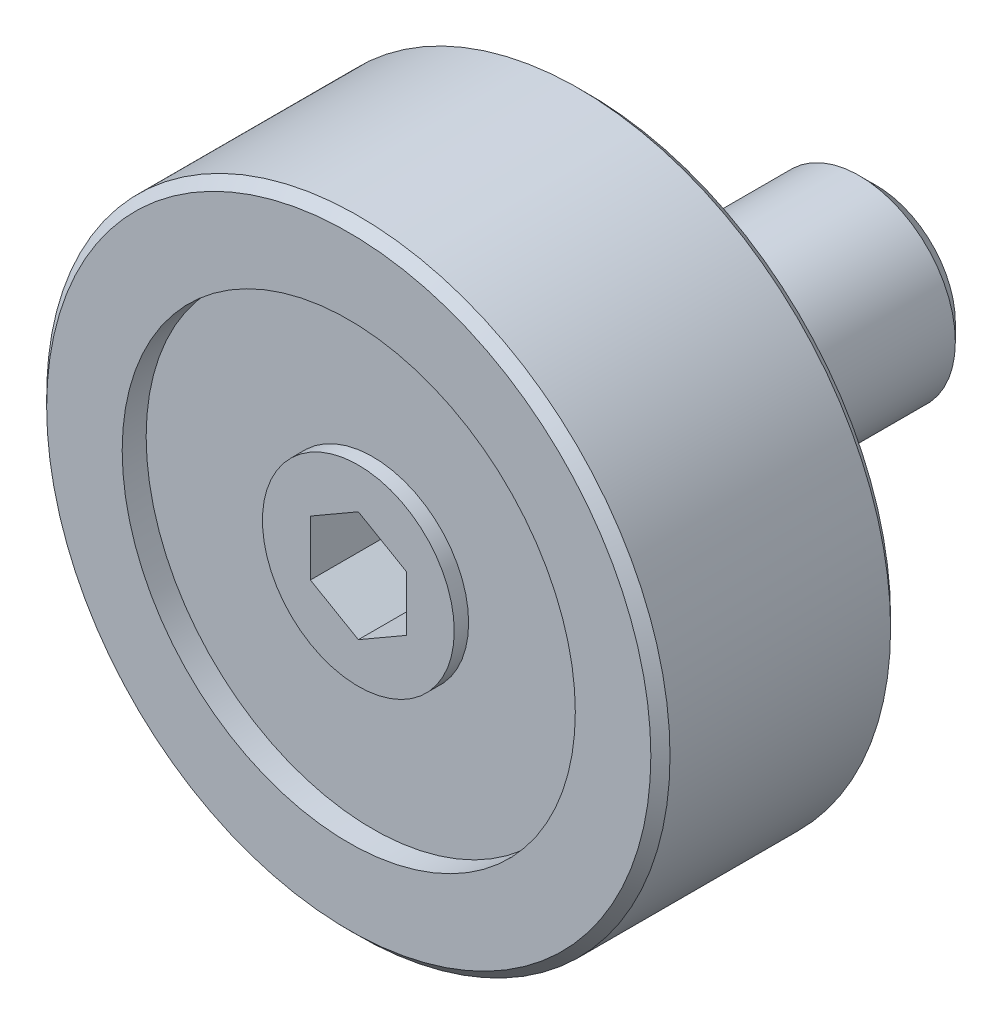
ISO-10303-21;
HEADER;
FILE_DESCRIPTION(('STEP AP214'),'2;1');
FILE_NAME('part.step','',(''),(''),'','','');
FILE_SCHEMA(('AUTOMOTIVE_DESIGN { 1 0 10303 214 1 1 1 1 }'));
ENDSEC;
DATA;
#1=APPLICATION_CONTEXT('core data for automotive mechanical design processes');
#2=APPLICATION_PROTOCOL_DEFINITION('international standard','automotive_design',2000,#1);
#3=PRODUCT_CONTEXT('',#1,'mechanical');
#4=PRODUCT('Part','Part','',(#3));
#5=PRODUCT_RELATED_PRODUCT_CATEGORY('part','',(#4));
#6=PRODUCT_DEFINITION_FORMATION('','',#4);
#7=PRODUCT_DEFINITION_CONTEXT('part definition',#1,'design');
#8=PRODUCT_DEFINITION('design','',#6,#7);
#9=PRODUCT_DEFINITION_SHAPE('','',#8);
#10=(LENGTH_UNIT() NAMED_UNIT(*) SI_UNIT(.MILLI.,.METRE.));
#11=(NAMED_UNIT(*) PLANE_ANGLE_UNIT() SI_UNIT($,.RADIAN.));
#12=(NAMED_UNIT(*) SI_UNIT($,.STERADIAN.) SOLID_ANGLE_UNIT());
#13=UNCERTAINTY_MEASURE_WITH_UNIT(LENGTH_MEASURE(1.E-05),#10,'distance_accuracy_value','');
#14=(GEOMETRIC_REPRESENTATION_CONTEXT(3) GLOBAL_UNCERTAINTY_ASSIGNED_CONTEXT((#13)) GLOBAL_UNIT_ASSIGNED_CONTEXT((#10,
#11,#12)) REPRESENTATION_CONTEXT('',''));
#15=CARTESIAN_POINT('',(0.,0.,0.));
#16=DIRECTION('',(0.,0.,1.));
#17=DIRECTION('',(1.,0.,0.));
#18=AXIS2_PLACEMENT_3D('',#15,#16,#17);
#19=CARTESIAN_POINT('',(0.,0.,1.19999999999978));
#20=DIRECTION('',(0.,0.,1.));
#21=DIRECTION('',(1.,0.,0.));
#22=AXIS2_PLACEMENT_3D('',#19,#20,#21);
#23=CONICAL_SURFACE('',#22,6.5,0.785398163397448);
#24=CARTESIAN_POINT('',(0.,0.,1.00000000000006));
#25=DIRECTION('',(0.,0.,1.));
#26=DIRECTION('',(1.,0.,0.));
#27=AXIS2_PLACEMENT_3D('',#24,#25,#26);
#28=CIRCLE('',#27,6.30000000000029);
#29=CARTESIAN_POINT('',(6.30000000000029,0.,1.00000000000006));
#30=VERTEX_POINT('',#29);
#31=EDGE_CURVE('E115',#30,#30,#28,.T.);
#32=ORIENTED_EDGE('',*,*,#31,.T.);
#33=EDGE_LOOP('',(#32));
#34=FACE_BOUND('',#33,.T.);
#35=CARTESIAN_POINT('',(0.,0.,1.19999999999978));
#36=DIRECTION('',(0.,0.,1.));
#37=DIRECTION('',(1.,0.,0.));
#38=AXIS2_PLACEMENT_3D('',#35,#36,#37);
#39=CIRCLE('',#38,6.5);
#40=CARTESIAN_POINT('',(6.5,0.,1.19999999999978));
#41=VERTEX_POINT('',#40);
#42=EDGE_CURVE('E9',#41,#41,#39,.T.);
#43=ORIENTED_EDGE('',*,*,#42,.F.);
#44=EDGE_LOOP('',(#43));
#45=FACE_BOUND('',#44,.T.);
#46=ADVANCED_FACE('F14',(#34,#45),#23,.T.);
#47=CARTESIAN_POINT('',(0.,0.,9.));
#48=DIRECTION('',(0.,0.,1.));
#49=DIRECTION('',(1.,0.,0.));
#50=AXIS2_PLACEMENT_3D('',#47,#48,#49);
#51=CYLINDRICAL_SURFACE('',#50,6.5);
#52=ORIENTED_EDGE('',*,*,#42,.T.);
#53=EDGE_LOOP('',(#52));
#54=FACE_BOUND('',#53,.T.);
#55=CARTESIAN_POINT('',(0.,0.,5.79999999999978));
#56=DIRECTION('',(0.,0.,1.));
#57=DIRECTION('',(1.,0.,0.));
#58=AXIS2_PLACEMENT_3D('',#55,#56,#57);
#59=CIRCLE('',#58,6.5);
#60=CARTESIAN_POINT('',(6.5,0.,5.79999999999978));
#61=VERTEX_POINT('',#60);
#62=EDGE_CURVE('E21',#61,#61,#59,.T.);
#63=ORIENTED_EDGE('',*,*,#62,.F.);
#64=EDGE_LOOP('',(#63));
#65=FACE_BOUND('',#64,.T.);
#66=ADVANCED_FACE('F170',(#54,#65),#51,.T.);
#67=CARTESIAN_POINT('',(0.,0.,5.99999999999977));
#68=DIRECTION('',(0.,0.,-1.));
#69=DIRECTION('',(-1.,0.,0.));
#70=AXIS2_PLACEMENT_3D('',#67,#68,#69);
#71=CONICAL_SURFACE('',#70,6.3,0.785398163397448);
#72=ORIENTED_EDGE('',*,*,#62,.T.);
#73=EDGE_LOOP('',(#72));
#74=FACE_BOUND('',#73,.T.);
#75=CARTESIAN_POINT('',(0.,0.,5.99999999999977));
#76=DIRECTION('',(0.,0.,1.));
#77=DIRECTION('',(1.,0.,0.));
#78=AXIS2_PLACEMENT_3D('',#75,#76,#77);
#79=CIRCLE('',#78,6.3);
#80=CARTESIAN_POINT('',(6.3,0.,5.99999999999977));
#81=VERTEX_POINT('',#80);
#82=EDGE_CURVE('E162',#81,#81,#79,.T.);
#83=ORIENTED_EDGE('',*,*,#82,.F.);
#84=EDGE_LOOP('',(#83));
#85=FACE_BOUND('',#84,.T.);
#86=ADVANCED_FACE('F167',(#74,#85),#71,.T.);
#87=CARTESIAN_POINT('',(0.,6.3,5.99999999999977));
#88=DIRECTION('',(0.,0.,1.));
#89=DIRECTION('',(1.,0.,0.));
#90=AXIS2_PLACEMENT_3D('',#87,#88,#89);
#91=PLANE('',#90);
#92=ORIENTED_EDGE('',*,*,#82,.T.);
#93=EDGE_LOOP('',(#92));
#94=FACE_BOUND('',#93,.T.);
#95=CARTESIAN_POINT('',(0.,0.,5.99999999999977));
#96=DIRECTION('',(0.,0.,1.));
#97=DIRECTION('',(1.,0.,0.));
#98=AXIS2_PLACEMENT_3D('',#95,#96,#97);
#99=CIRCLE('',#98,4.725);
#100=CARTESIAN_POINT('',(4.725,0.,5.99999999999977));
#101=VERTEX_POINT('',#100);
#102=EDGE_CURVE('E159',#101,#101,#99,.T.);
#103=ORIENTED_EDGE('',*,*,#102,.F.);
#104=EDGE_LOOP('',(#103));
#105=FACE_BOUND('',#104,.T.);
#106=ADVANCED_FACE('F179',(#94,#105),#91,.T.);
#107=CARTESIAN_POINT('',(0.,0.,9.));
#108=DIRECTION('',(0.,0.,1.));
#109=DIRECTION('',(1.,0.,0.));
#110=AXIS2_PLACEMENT_3D('',#107,#108,#109);
#111=CYLINDRICAL_SURFACE('',#110,4.725);
#112=ORIENTED_EDGE('',*,*,#102,.T.);
#113=EDGE_LOOP('',(#112));
#114=FACE_BOUND('',#113,.T.);
#115=CARTESIAN_POINT('',(0.,0.,5.49999999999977));
#116=DIRECTION('',(0.,0.,1.));
#117=DIRECTION('',(1.,0.,0.));
#118=AXIS2_PLACEMENT_3D('',#115,#116,#117);
#119=CIRCLE('',#118,4.725);
#120=CARTESIAN_POINT('',(4.725,0.,5.49999999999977));
#121=VERTEX_POINT('',#120);
#122=EDGE_CURVE('E156',#121,#121,#119,.T.);
#123=ORIENTED_EDGE('',*,*,#122,.F.);
#124=EDGE_LOOP('',(#123));
#125=FACE_BOUND('',#124,.T.);
#126=ADVANCED_FACE('F185',(#114,#125),#111,.F.);
#127=CARTESIAN_POINT('',(0.,4.725,5.49999999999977));
#128=DIRECTION('',(0.,0.,1.));
#129=DIRECTION('',(1.,0.,0.));
#130=AXIS2_PLACEMENT_3D('',#127,#128,#129);
#131=PLANE('',#130);
#132=ORIENTED_EDGE('',*,*,#122,.T.);
#133=EDGE_LOOP('',(#132));
#134=FACE_BOUND('',#133,.T.);
#135=CARTESIAN_POINT('',(0.,0.,5.49999999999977));
#136=DIRECTION('',(0.,0.,1.));
#137=DIRECTION('',(1.,0.,0.));
#138=AXIS2_PLACEMENT_3D('',#135,#136,#137);
#139=CIRCLE('',#138,2.);
#140=CARTESIAN_POINT('',(2.,0.,5.49999999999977));
#141=VERTEX_POINT('',#140);
#142=EDGE_CURVE('E153',#141,#141,#139,.T.);
#143=ORIENTED_EDGE('',*,*,#142,.F.);
#144=EDGE_LOOP('',(#143));
#145=FACE_BOUND('',#144,.T.);
#146=ADVANCED_FACE('F189',(#134,#145),#131,.T.);
#147=CARTESIAN_POINT('',(0.,0.,9.));
#148=DIRECTION('',(0.,0.,1.));
#149=DIRECTION('',(1.,0.,0.));
#150=AXIS2_PLACEMENT_3D('',#147,#148,#149);
#151=CYLINDRICAL_SURFACE('',#150,2.);
#152=ORIENTED_EDGE('',*,*,#142,.T.);
#153=EDGE_LOOP('',(#152));
#154=FACE_BOUND('',#153,.T.);
#155=CARTESIAN_POINT('',(0.,0.,5.79999999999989));
#156=DIRECTION('',(0.,0.,1.));
#157=DIRECTION('',(1.,0.,0.));
#158=AXIS2_PLACEMENT_3D('',#155,#156,#157);
#159=CIRCLE('',#158,2.);
#160=CARTESIAN_POINT('',(2.,0.,5.79999999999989));
#161=VERTEX_POINT('',#160);
#162=EDGE_CURVE('E150',#161,#161,#159,.T.);
#163=ORIENTED_EDGE('',*,*,#162,.F.);
#164=EDGE_LOOP('',(#163));
#165=FACE_BOUND('',#164,.T.);
#166=ADVANCED_FACE('F193',(#154,#165),#151,.T.);
#167=CARTESIAN_POINT('',(0.,2.,5.79999999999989));
#168=DIRECTION('',(0.,0.,1.));
#169=DIRECTION('',(1.,0.,0.));
#170=AXIS2_PLACEMENT_3D('',#167,#168,#169);
#171=PLANE('',#170);
#172=DIRECTION('',(-0.866025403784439,0.5,0.));
#173=VECTOR('',#172,1.);
#174=CARTESIAN_POINT('',(1.,0.577350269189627,5.79999999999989));
#175=LINE('',#174,#173);
#176=CARTESIAN_POINT('',(1.,0.577350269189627,5.79999999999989));
#177=VERTEX_POINT('',#176);
#178=CARTESIAN_POINT('',(0.,1.15470053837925,5.79999999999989));
#179=VERTEX_POINT('',#178);
#180=EDGE_CURVE('E28',#177,#179,#175,.T.);
#181=ORIENTED_EDGE('',*,*,#180,.F.);
#182=DIRECTION('',(0.,1.,0.));
#183=VECTOR('',#182,1.);
#184=CARTESIAN_POINT('',(1.,-0.577350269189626,5.79999999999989));
#185=LINE('',#184,#183);
#186=CARTESIAN_POINT('',(1.,-0.577350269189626,5.79999999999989));
#187=VERTEX_POINT('',#186);
#188=EDGE_CURVE('E111',#187,#177,#185,.T.);
#189=ORIENTED_EDGE('',*,*,#188,.F.);
#190=DIRECTION('',(0.866025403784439,0.5,0.));
#191=VECTOR('',#190,1.);
#192=CARTESIAN_POINT('',(0.,-1.15470053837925,5.79999999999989));
#193=LINE('',#192,#191);
#194=CARTESIAN_POINT('',(0.,-1.15470053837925,5.79999999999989));
#195=VERTEX_POINT('',#194);
#196=EDGE_CURVE('E109',#195,#187,#193,.T.);
#197=ORIENTED_EDGE('',*,*,#196,.F.);
#198=DIRECTION('',(0.866025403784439,-0.5,0.));
#199=VECTOR('',#198,1.);
#200=CARTESIAN_POINT('',(-1.,-0.577350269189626,5.79999999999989));
#201=LINE('',#200,#199);
#202=CARTESIAN_POINT('',(-1.,-0.577350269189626,5.79999999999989));
#203=VERTEX_POINT('',#202);
#204=EDGE_CURVE('E76',#203,#195,#201,.T.);
#205=ORIENTED_EDGE('',*,*,#204,.F.);
#206=DIRECTION('',(0.,-1.,0.));
#207=VECTOR('',#206,1.);
#208=CARTESIAN_POINT('',(-1.,0.577350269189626,5.79999999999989));
#209=LINE('',#208,#207);
#210=CARTESIAN_POINT('',(-1.,0.577350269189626,5.79999999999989));
#211=VERTEX_POINT('',#210);
#212=EDGE_CURVE('E105',#211,#203,#209,.T.);
#213=ORIENTED_EDGE('',*,*,#212,.F.);
#214=DIRECTION('',(-0.866025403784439,-0.5,0.));
#215=VECTOR('',#214,1.);
#216=CARTESIAN_POINT('',(0.,1.15470053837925,5.79999999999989));
#217=LINE('',#216,#215);
#218=EDGE_CURVE('E102',#179,#211,#217,.T.);
#219=ORIENTED_EDGE('',*,*,#218,.F.);
#220=EDGE_LOOP('',(#181,#189,#197,#205,#213,#219));
#221=FACE_BOUND('',#220,.T.);
#222=ORIENTED_EDGE('',*,*,#162,.T.);
#223=EDGE_LOOP('',(#222));
#224=FACE_BOUND('',#223,.T.);
#225=ADVANCED_FACE('F197',(#221,#224),#171,.T.);
#226=CARTESIAN_POINT('',(0.,-1.32413961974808E-13,-5.));
#227=DIRECTION('',(0.,0.,-1.));
#228=DIRECTION('',(-1.,0.,0.));
#229=AXIS2_PLACEMENT_3D('',#226,#227,#228);
#230=PLANE('',#229);
#231=CARTESIAN_POINT('',(0.,0.,-5.));
#232=DIRECTION('',(0.,0.,1.));
#233=DIRECTION('',(1.,0.,0.));
#234=AXIS2_PLACEMENT_3D('',#231,#232,#233);
#235=CIRCLE('',#234,1.64999999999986);
#236=CARTESIAN_POINT('',(1.64999999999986,0.,-5.));
#237=VERTEX_POINT('',#236);
#238=EDGE_CURVE('E147',#237,#237,#235,.T.);
#239=ORIENTED_EDGE('',*,*,#238,.F.);
#240=EDGE_LOOP('',(#239));
#241=FACE_BOUND('',#240,.T.);
#242=ADVANCED_FACE('F201',(#241),#230,.T.);
#243=CARTESIAN_POINT('',(0.,0.,-4.65));
#244=DIRECTION('',(0.,0.,1.));
#245=DIRECTION('',(1.,0.,0.));
#246=AXIS2_PLACEMENT_3D('',#243,#244,#245);
#247=CONICAL_SURFACE('',#246,1.99999999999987,0.785398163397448);
#248=ORIENTED_EDGE('',*,*,#238,.T.);
#249=EDGE_LOOP('',(#248));
#250=FACE_BOUND('',#249,.T.);
#251=CARTESIAN_POINT('',(0.,0.,-4.65));
#252=DIRECTION('',(0.,0.,1.));
#253=DIRECTION('',(1.,0.,0.));
#254=AXIS2_PLACEMENT_3D('',#251,#252,#253);
#255=CIRCLE('',#254,1.99999999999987);
#256=CARTESIAN_POINT('',(1.99999999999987,0.,-4.65));
#257=VERTEX_POINT('',#256);
#258=EDGE_CURVE('E144',#257,#257,#255,.T.);
#259=ORIENTED_EDGE('',*,*,#258,.F.);
#260=EDGE_LOOP('',(#259));
#261=FACE_BOUND('',#260,.T.);
#262=ADVANCED_FACE('F205',(#250,#261),#247,.T.);
#263=CARTESIAN_POINT('',(0.,0.,9.));
#264=DIRECTION('',(0.,0.,1.));
#265=DIRECTION('',(1.,0.,0.));
#266=AXIS2_PLACEMENT_3D('',#263,#264,#265);
#267=CYLINDRICAL_SURFACE('',#266,1.99999999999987);
#268=ORIENTED_EDGE('',*,*,#258,.T.);
#269=EDGE_LOOP('',(#268));
#270=FACE_BOUND('',#269,.T.);
#271=CARTESIAN_POINT('',(0.,0.,-1.));
#272=DIRECTION('',(0.,0.,1.));
#273=DIRECTION('',(1.,0.,0.));
#274=AXIS2_PLACEMENT_3D('',#271,#272,#273);
#275=CIRCLE('',#274,1.99999999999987);
#276=CARTESIAN_POINT('',(1.99999999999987,0.,-1.));
#277=VERTEX_POINT('',#276);
#278=EDGE_CURVE('E141',#277,#277,#275,.T.);
#279=ORIENTED_EDGE('',*,*,#278,.F.);
#280=EDGE_LOOP('',(#279));
#281=FACE_BOUND('',#280,.T.);
#282=ADVANCED_FACE('F209',(#270,#281),#267,.T.);
#283=CARTESIAN_POINT('',(0.,1.44999999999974,-1.));
#284=DIRECTION('',(0.,0.,1.));
#285=DIRECTION('',(1.,0.,0.));
#286=AXIS2_PLACEMENT_3D('',#283,#284,#285);
#287=PLANE('',#286);
#288=ORIENTED_EDGE('',*,*,#278,.T.);
#289=EDGE_LOOP('',(#288));
#290=FACE_BOUND('',#289,.T.);
#291=CARTESIAN_POINT('',(0.,0.,-1.));
#292=DIRECTION('',(0.,0.,1.));
#293=DIRECTION('',(1.,0.,0.));
#294=AXIS2_PLACEMENT_3D('',#291,#292,#293);
#295=CIRCLE('',#294,1.44999999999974);
#296=CARTESIAN_POINT('',(1.44999999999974,0.,-1.));
#297=VERTEX_POINT('',#296);
#298=EDGE_CURVE('E138',#297,#297,#295,.T.);
#299=ORIENTED_EDGE('',*,*,#298,.F.);
#300=EDGE_LOOP('',(#299));
#301=FACE_BOUND('',#300,.T.);
#302=ADVANCED_FACE('F213',(#290,#301),#287,.T.);
#303=CARTESIAN_POINT('',(0.,0.,9.));
#304=DIRECTION('',(0.,0.,1.));
#305=DIRECTION('',(1.,0.,0.));
#306=AXIS2_PLACEMENT_3D('',#303,#304,#305);
#307=CYLINDRICAL_SURFACE('',#306,1.44999999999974);
#308=ORIENTED_EDGE('',*,*,#298,.T.);
#309=EDGE_LOOP('',(#308));
#310=FACE_BOUND('',#309,.T.);
#311=CARTESIAN_POINT('',(0.,0.,0.));
#312=DIRECTION('',(0.,0.,1.));
#313=DIRECTION('',(1.,0.,0.));
#314=AXIS2_PLACEMENT_3D('',#311,#312,#313);
#315=CIRCLE('',#314,1.44999999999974);
#316=CARTESIAN_POINT('',(1.44999999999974,0.,0.));
#317=VERTEX_POINT('',#316);
#318=EDGE_CURVE('E135',#317,#317,#315,.T.);
#319=ORIENTED_EDGE('',*,*,#318,.F.);
#320=EDGE_LOOP('',(#319));
#321=FACE_BOUND('',#320,.T.);
#322=ADVANCED_FACE('F217',(#310,#321),#307,.T.);
#323=CARTESIAN_POINT('',(0.,2.99999999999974,0.));
#324=DIRECTION('',(0.,0.,-1.));
#325=DIRECTION('',(-1.,0.,0.));
#326=AXIS2_PLACEMENT_3D('',#323,#324,#325);
#327=PLANE('',#326);
#328=ORIENTED_EDGE('',*,*,#318,.T.);
#329=EDGE_LOOP('',(#328));
#330=FACE_BOUND('',#329,.T.);
#331=CARTESIAN_POINT('',(0.,0.,0.));
#332=DIRECTION('',(0.,0.,1.));
#333=DIRECTION('',(1.,0.,0.));
#334=AXIS2_PLACEMENT_3D('',#331,#332,#333);
#335=CIRCLE('',#334,2.99999999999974);
#336=CARTESIAN_POINT('',(2.99999999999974,0.,0.));
#337=VERTEX_POINT('',#336);
#338=EDGE_CURVE('E132',#337,#337,#335,.T.);
#339=ORIENTED_EDGE('',*,*,#338,.F.);
#340=EDGE_LOOP('',(#339));
#341=FACE_BOUND('',#340,.T.);
#342=ADVANCED_FACE('F221',(#330,#341),#327,.T.);
#343=CARTESIAN_POINT('',(0.,0.,9.));
#344=DIRECTION('',(0.,0.,1.));
#345=DIRECTION('',(1.,0.,0.));
#346=AXIS2_PLACEMENT_3D('',#343,#344,#345);
#347=CYLINDRICAL_SURFACE('',#346,2.99999999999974);
#348=ORIENTED_EDGE('',*,*,#338,.T.);
#349=EDGE_LOOP('',(#348));
#350=FACE_BOUND('',#349,.T.);
#351=CARTESIAN_POINT('',(0.,0.,1.5));
#352=DIRECTION('',(0.,0.,1.));
#353=DIRECTION('',(1.,0.,0.));
#354=AXIS2_PLACEMENT_3D('',#351,#352,#353);
#355=CIRCLE('',#354,2.99999999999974);
#356=CARTESIAN_POINT('',(2.99999999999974,0.,1.5));
#357=VERTEX_POINT('',#356);
#358=EDGE_CURVE('E129',#357,#357,#355,.T.);
#359=ORIENTED_EDGE('',*,*,#358,.F.);
#360=EDGE_LOOP('',(#359));
#361=FACE_BOUND('',#360,.T.);
#362=ADVANCED_FACE('F225',(#350,#361),#347,.T.);
#363=CARTESIAN_POINT('',(0.,2.99999999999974,1.5));
#364=DIRECTION('',(0.,0.,-1.));
#365=DIRECTION('',(-1.,0.,0.));
#366=AXIS2_PLACEMENT_3D('',#363,#364,#365);
#367=PLANE('',#366);
#368=ORIENTED_EDGE('',*,*,#358,.T.);
#369=EDGE_LOOP('',(#368));
#370=FACE_BOUND('',#369,.T.);
#371=CARTESIAN_POINT('',(0.,0.,1.5));
#372=DIRECTION('',(0.,0.,1.));
#373=DIRECTION('',(1.,0.,0.));
#374=AXIS2_PLACEMENT_3D('',#371,#372,#373);
#375=CIRCLE('',#374,4.72500000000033);
#376=CARTESIAN_POINT('',(4.72500000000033,0.,1.5));
#377=VERTEX_POINT('',#376);
#378=EDGE_CURVE('E126',#377,#377,#375,.T.);
#379=ORIENTED_EDGE('',*,*,#378,.F.);
#380=EDGE_LOOP('',(#379));
#381=FACE_BOUND('',#380,.T.);
#382=ADVANCED_FACE('F229',(#370,#381),#367,.T.);
#383=CARTESIAN_POINT('',(0.,0.,9.));
#384=DIRECTION('',(0.,0.,1.));
#385=DIRECTION('',(1.,0.,0.));
#386=AXIS2_PLACEMENT_3D('',#383,#384,#385);
#387=CYLINDRICAL_SURFACE('',#386,4.72500000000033);
#388=ORIENTED_EDGE('',*,*,#378,.T.);
#389=EDGE_LOOP('',(#388));
#390=FACE_BOUND('',#389,.T.);
#391=CARTESIAN_POINT('',(0.,0.,1.00000000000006));
#392=DIRECTION('',(0.,0.,1.));
#393=DIRECTION('',(1.,0.,0.));
#394=AXIS2_PLACEMENT_3D('',#391,#392,#393);
#395=CIRCLE('',#394,4.72500000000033);
#396=CARTESIAN_POINT('',(4.72500000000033,0.,1.00000000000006));
#397=VERTEX_POINT('',#396);
#398=EDGE_CURVE('E123',#397,#397,#395,.T.);
#399=ORIENTED_EDGE('',*,*,#398,.F.);
#400=EDGE_LOOP('',(#399));
#401=FACE_BOUND('',#400,.T.);
#402=ADVANCED_FACE('F233',(#390,#401),#387,.F.);
#403=CARTESIAN_POINT('',(0.,6.30000000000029,1.00000000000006));
#404=DIRECTION('',(0.,0.,-1.));
#405=DIRECTION('',(-1.,0.,0.));
#406=AXIS2_PLACEMENT_3D('',#403,#404,#405);
#407=PLANE('',#406);
#408=ORIENTED_EDGE('',*,*,#398,.T.);
#409=EDGE_LOOP('',(#408));
#410=FACE_BOUND('',#409,.T.);
#411=ORIENTED_EDGE('',*,*,#31,.F.);
#412=EDGE_LOOP('',(#411));
#413=FACE_BOUND('',#412,.T.);
#414=ADVANCED_FACE('F237',(#410,#413),#407,.T.);
#415=CARTESIAN_POINT('',(1.,0.577350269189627,4.19999999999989));
#416=DIRECTION('',(0.5,0.866025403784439,0.));
#417=DIRECTION('',(-0.866025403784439,0.5,0.));
#418=AXIS2_PLACEMENT_3D('',#415,#416,#417);
#419=PLANE('',#418);
#420=ORIENTED_EDGE('',*,*,#180,.T.);
#421=DIRECTION('',(0.,0.,1.));
#422=VECTOR('',#421,1.);
#423=CARTESIAN_POINT('',(0.,1.15470053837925,4.19999999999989));
#424=LINE('',#423,#422);
#425=CARTESIAN_POINT('',(0.,1.15470053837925,4.19999999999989));
#426=VERTEX_POINT('',#425);
#427=EDGE_CURVE('E58',#426,#179,#424,.T.);
#428=ORIENTED_EDGE('',*,*,#427,.F.);
#429=DIRECTION('',(-0.866025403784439,0.5,0.));
#430=VECTOR('',#429,1.);
#431=CARTESIAN_POINT('',(1.,0.577350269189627,4.19999999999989));
#432=LINE('',#431,#430);
#433=CARTESIAN_POINT('',(1.,0.577350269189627,4.19999999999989));
#434=VERTEX_POINT('',#433);
#435=EDGE_CURVE('E113',#434,#426,#432,.T.);
#436=ORIENTED_EDGE('',*,*,#435,.F.);
#437=DIRECTION('',(0.,0.,1.));
#438=VECTOR('',#437,1.);
#439=CARTESIAN_POINT('',(1.,0.577350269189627,4.19999999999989));
#440=LINE('',#439,#438);
#441=EDGE_CURVE('E36',#434,#177,#440,.T.);
#442=ORIENTED_EDGE('',*,*,#441,.T.);
#443=EDGE_LOOP('',(#420,#428,#436,#442));
#444=FACE_BOUND('',#443,.T.);
#445=ADVANCED_FACE('F241',(#444),#419,.F.);
#446=CARTESIAN_POINT('',(1.,-0.577350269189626,4.19999999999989));
#447=DIRECTION('',(1.,0.,0.));
#448=DIRECTION('',(0.,0.,-1.));
#449=AXIS2_PLACEMENT_3D('',#446,#447,#448);
#450=PLANE('',#449);
#451=ORIENTED_EDGE('',*,*,#188,.T.);
#452=ORIENTED_EDGE('',*,*,#441,.F.);
#453=DIRECTION('',(0.,1.,0.));
#454=VECTOR('',#453,1.);
#455=CARTESIAN_POINT('',(1.,-0.577350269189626,4.19999999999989));
#456=LINE('',#455,#454);
#457=CARTESIAN_POINT('',(1.,-0.577350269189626,4.19999999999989));
#458=VERTEX_POINT('',#457);
#459=EDGE_CURVE('E88',#458,#434,#456,.T.);
#460=ORIENTED_EDGE('',*,*,#459,.F.);
#461=DIRECTION('',(0.,0.,1.));
#462=VECTOR('',#461,1.);
#463=CARTESIAN_POINT('',(1.,-0.577350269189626,4.19999999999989));
#464=LINE('',#463,#462);
#465=EDGE_CURVE('E80',#458,#187,#464,.T.);
#466=ORIENTED_EDGE('',*,*,#465,.T.);
#467=EDGE_LOOP('',(#451,#452,#460,#466));
#468=FACE_BOUND('',#467,.T.);
#469=ADVANCED_FACE('F245',(#468),#450,.F.);
#470=CARTESIAN_POINT('',(0.,-1.15470053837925,4.19999999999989));
#471=DIRECTION('',(0.5,-0.866025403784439,0.));
#472=DIRECTION('',(0.866025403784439,0.5,0.));
#473=AXIS2_PLACEMENT_3D('',#470,#471,#472);
#474=PLANE('',#473);
#475=ORIENTED_EDGE('',*,*,#196,.T.);
#476=ORIENTED_EDGE('',*,*,#465,.F.);
#477=DIRECTION('',(0.866025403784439,0.5,0.));
#478=VECTOR('',#477,1.);
#479=CARTESIAN_POINT('',(0.,-1.15470053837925,4.19999999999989));
#480=LINE('',#479,#478);
#481=CARTESIAN_POINT('',(0.,-1.15470053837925,4.19999999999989));
#482=VERTEX_POINT('',#481);
#483=EDGE_CURVE('E84',#482,#458,#480,.T.);
#484=ORIENTED_EDGE('',*,*,#483,.F.);
#485=DIRECTION('',(0.,0.,1.));
#486=VECTOR('',#485,1.);
#487=CARTESIAN_POINT('',(0.,-1.15470053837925,4.19999999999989));
#488=LINE('',#487,#486);
#489=EDGE_CURVE('E69',#482,#195,#488,.T.);
#490=ORIENTED_EDGE('',*,*,#489,.T.);
#491=EDGE_LOOP('',(#475,#476,#484,#490));
#492=FACE_BOUND('',#491,.T.);
#493=ADVANCED_FACE('F85',(#492),#474,.F.);
#494=CARTESIAN_POINT('',(-1.,-0.577350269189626,4.19999999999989));
#495=DIRECTION('',(-0.5,-0.866025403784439,0.));
#496=DIRECTION('',(0.866025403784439,-0.5,0.));
#497=AXIS2_PLACEMENT_3D('',#494,#495,#496);
#498=PLANE('',#497);
#499=ORIENTED_EDGE('',*,*,#204,.T.);
#500=ORIENTED_EDGE('',*,*,#489,.F.);
#501=DIRECTION('',(0.866025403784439,-0.5,0.));
#502=VECTOR('',#501,1.);
#503=CARTESIAN_POINT('',(-1.,-0.577350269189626,4.19999999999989));
#504=LINE('',#503,#502);
#505=CARTESIAN_POINT('',(-1.,-0.577350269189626,4.19999999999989));
#506=VERTEX_POINT('',#505);
#507=EDGE_CURVE('E73',#506,#482,#504,.T.);
#508=ORIENTED_EDGE('',*,*,#507,.F.);
#509=DIRECTION('',(0.,0.,1.));
#510=VECTOR('',#509,1.);
#511=CARTESIAN_POINT('',(-1.,-0.577350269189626,4.19999999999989));
#512=LINE('',#511,#510);
#513=EDGE_CURVE('E81',#506,#203,#512,.T.);
#514=ORIENTED_EDGE('',*,*,#513,.T.);
#515=EDGE_LOOP('',(#499,#500,#508,#514));
#516=FACE_BOUND('',#515,.T.);
#517=ADVANCED_FACE('F71',(#516),#498,.F.);
#518=CARTESIAN_POINT('',(-1.,0.577350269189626,4.19999999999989));
#519=DIRECTION('',(-1.,0.,0.));
#520=DIRECTION('',(0.,-1.,0.));
#521=AXIS2_PLACEMENT_3D('',#518,#519,#520);
#522=PLANE('',#521);
#523=ORIENTED_EDGE('',*,*,#212,.T.);
#524=ORIENTED_EDGE('',*,*,#513,.F.);
#525=DIRECTION('',(0.,-1.,0.));
#526=VECTOR('',#525,1.);
#527=CARTESIAN_POINT('',(-1.,0.577350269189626,4.19999999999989));
#528=LINE('',#527,#526);
#529=CARTESIAN_POINT('',(-1.,0.577350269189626,4.19999999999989));
#530=VERTEX_POINT('',#529);
#531=EDGE_CURVE('E94',#530,#506,#528,.T.);
#532=ORIENTED_EDGE('',*,*,#531,.F.);
#533=DIRECTION('',(0.,0.,1.));
#534=VECTOR('',#533,1.);
#535=CARTESIAN_POINT('',(-1.,0.577350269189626,4.19999999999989));
#536=LINE('',#535,#534);
#537=EDGE_CURVE('E118',#530,#211,#536,.T.);
#538=ORIENTED_EDGE('',*,*,#537,.T.);
#539=EDGE_LOOP('',(#523,#524,#532,#538));
#540=FACE_BOUND('',#539,.T.);
#541=ADVANCED_FACE('F249',(#540),#522,.F.);
#542=CARTESIAN_POINT('',(0.,1.15470053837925,4.19999999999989));
#543=DIRECTION('',(-0.5,0.866025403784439,0.));
#544=DIRECTION('',(-0.866025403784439,-0.5,0.));
#545=AXIS2_PLACEMENT_3D('',#542,#543,#544);
#546=PLANE('',#545);
#547=ORIENTED_EDGE('',*,*,#218,.T.);
#548=ORIENTED_EDGE('',*,*,#537,.F.);
#549=DIRECTION('',(-0.866025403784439,-0.5,0.));
#550=VECTOR('',#549,1.);
#551=CARTESIAN_POINT('',(0.,1.15470053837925,4.19999999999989));
#552=LINE('',#551,#550);
#553=EDGE_CURVE('E96',#426,#530,#552,.T.);
#554=ORIENTED_EDGE('',*,*,#553,.F.);
#555=ORIENTED_EDGE('',*,*,#427,.T.);
#556=EDGE_LOOP('',(#547,#548,#554,#555));
#557=FACE_BOUND('',#556,.T.);
#558=ADVANCED_FACE('F246',(#557),#546,.F.);
#559=CARTESIAN_POINT('',(0.,0.,4.19999999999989));
#560=DIRECTION('',(0.,0.,1.));
#561=DIRECTION('',(1.,0.,0.));
#562=AXIS2_PLACEMENT_3D('',#559,#560,#561);
#563=PLANE('',#562);
#564=ORIENTED_EDGE('',*,*,#435,.T.);
#565=ORIENTED_EDGE('',*,*,#553,.T.);
#566=ORIENTED_EDGE('',*,*,#531,.T.);
#567=ORIENTED_EDGE('',*,*,#507,.T.);
#568=ORIENTED_EDGE('',*,*,#483,.T.);
#569=ORIENTED_EDGE('',*,*,#459,.T.);
#570=EDGE_LOOP('',(#564,#565,#566,#567,#568,#569));
#571=FACE_BOUND('',#570,.T.);
#572=ADVANCED_FACE('F91',(#571),#563,.T.);
#573=CLOSED_SHELL('',(#46,#66,#86,#106,#126,#146,#166,#225,#242,#262,#282,#302,#322,#342,#362,
#382,#402,#414,#445,#469,#493,#517,#541,#558,#572));
#574=MANIFOLD_SOLID_BREP('B1',#573);
#575=ADVANCED_BREP_SHAPE_REPRESENTATION('',(#18,#574),#14);
#576=SHAPE_DEFINITION_REPRESENTATION(#9,#575);
ENDSEC;
END-ISO-10303-21;
